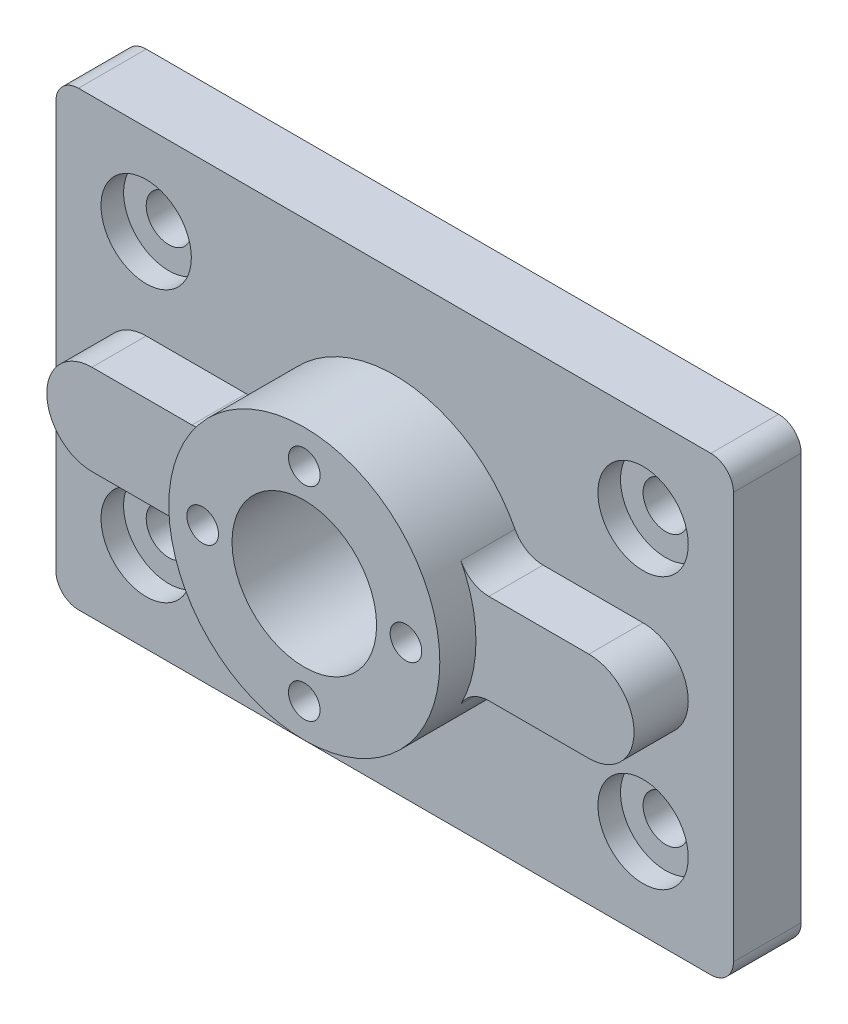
from build123d import *

# Parameters (mm, degrees)
SKETCH1_R             = 16
BOSS_EXTRUDE1_DEPTH   = 15
SKETCH2_R             = 30
SKETCH2_R_2           = 16
BOSS_EXTRUDE2_DEPTH   = 20
CUT_EXTRUDE1_DEPTH    = 12
SKETCH3_3_R           = 5
CUT_EXTRUDE2_DEPTH    = 25
SKETCH4_R             = 10
CUT_EXTRUDE3_DEPTH    = 5
M8X1_0_TAPPED_HOLE1_D = 7
CIRPATTERN1_COUNT     = 4
BOSS_EXTRUDE3_DEPTH   = 12
FILLET1_R             = 7


with BuildPart() as part:
    # Sketch1 → Boss-Extrude1 (new body)
    with BuildSketch(Plane.XY):
        with BuildLine():
            Line((5, 0), (145, 0))
            ThreePointArc((145, 0), (148.535533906, 1.464466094), (150, 5))
            Line((150, 5), (150, 95))
            ThreePointArc((150, 95), (148.535533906, 98.535533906), (145, 100))
            Line((145, 100), (5, 100))
            ThreePointArc((5, 100), (1.464466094, 98.535533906), (0, 95))
            Line((0, 95), (0, 5))
            ThreePointArc((0, 5), (1.464466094, 1.464466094), (5, 0))
        make_face()
        with Locations((75, 50)):
            Circle(SKETCH1_R, mode=Mode.SUBTRACT)
    extrude(amount=BOSS_EXTRUDE1_DEPTH)

    # Sketch2 → Boss-Extrude2 (add)
    with BuildSketch(Plane.XY.offset(15)):
        with Locations((75, 50)):
            Circle(SKETCH2_R)
        with Locations((75, 50)):
            Circle(SKETCH2_R_2, mode=Mode.SUBTRACT)
    extrude(amount=BOSS_EXTRUDE2_DEPTH)

    # Sketch3 → Cut-Extrude1 (cut)
    with BuildSketch(Plane(origin=(0, 0, 0), x_dir=(-1, 0, 0), z_dir=(0, 0, -1))):
        with BuildLine():
            Line((-45, 15), (-105, 15))
            ThreePointArc((-105, 15), (-108.535533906, 16.464466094), (-110, 20))
            Line((-110, 20), (-110, 80))
            ThreePointArc((-110, 80), (-108.535533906, 83.535533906), (-105, 85))
            Line((-105, 85), (-45, 85))
            ThreePointArc((-45, 85), (-41.464466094, 83.535533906), (-40, 80))
            Line((-40, 80), (-40, 20))
            ThreePointArc((-40, 20), (-41.464466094, 16.464466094), (-45, 15))
        make_face()
    extrude(amount=-CUT_EXTRUDE1_DEPTH, mode=Mode.SUBTRACT)

    # Sketch3_3 → Cut-Extrude2 (cut)
    with BuildSketch(Plane(origin=(0, 0, 0), x_dir=(-1, 0, 0), z_dir=(0, 0, -1))):
        with Locations((-20, 20)):
            Circle(SKETCH3_3_R)
        with Locations((-20, 80)):
            Circle(SKETCH3_3_R)
        with Locations((-130, 80)):
            Circle(SKETCH3_3_R)
        with Locations((-130, 20)):
            Circle(SKETCH3_3_R)
    extrude(amount=-CUT_EXTRUDE2_DEPTH, mode=Mode.SUBTRACT)

    # Sketch4 → Cut-Extrude3 (cut)
    with BuildSketch(Plane.XY.offset(15)):
        with Locations((20, 80)):
            Circle(SKETCH4_R)
        with Locations((20, 20)):
            Circle(SKETCH4_R)
        with Locations((130, 80)):
            Circle(SKETCH4_R)
        with Locations((130, 20)):
            Circle(SKETCH4_R)
    extrude(amount=-CUT_EXTRUDE3_DEPTH, mode=Mode.SUBTRACT)

    # M8x1.0 Tapped Hole1 (through all)
    with Locations(Plane.XY.offset(35)):
        with Locations((52.5, 50)):
            m8x1_0_tapped_hole1 = Hole(M8X1_0_TAPPED_HOLE1_D / 2)

    # CirPattern1: M8x1.0 Tapped Hole1 ×4 about axis
    cirpattern1_axis = Axis((75, 50, 0), (0, 0, 1))
    for i in range(1, CIRPATTERN1_COUNT):
        add(m8x1_0_tapped_hole1.rotate(cirpattern1_axis, i * 360 / CIRPATTERN1_COUNT), mode=Mode.SUBTRACT)

    # Sketch7 → Boss-Extrude3 (add)
    with BuildSketch(Plane.XY.offset(15)):
        with BuildLine():
            Line((130, 60), (103.284271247, 60))
            ThreePointArc((103.284271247, 60), (105, 50), (103.284271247, 40))
            Line((103.284271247, 40), (130, 40))
            ThreePointArc((130, 40), (140, 50), (130, 60))
        make_face()
        with BuildLine():
            Line((20, 40), (46.715728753, 40))
            ThreePointArc((46.715728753, 40), (45, 50), (46.715728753, 60))
            Line((46.715728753, 60), (20, 60))
            ThreePointArc((20, 60), (10, 50), (20, 40))
        make_face()
    extrude(amount=BOSS_EXTRUDE3_DEPTH)

    # Fillet1
    fillet1_edges = [part.edges().sort_by_distance(p)[0] for p in [
        (103.284271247, 60, 21),
        (103.284271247, 40, 21),
        (46.715728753, 40, 21),
        (46.715728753, 60, 21),
    ]]
    fillet(fillet1_edges, radius=FILLET1_R)


solid = part.part
